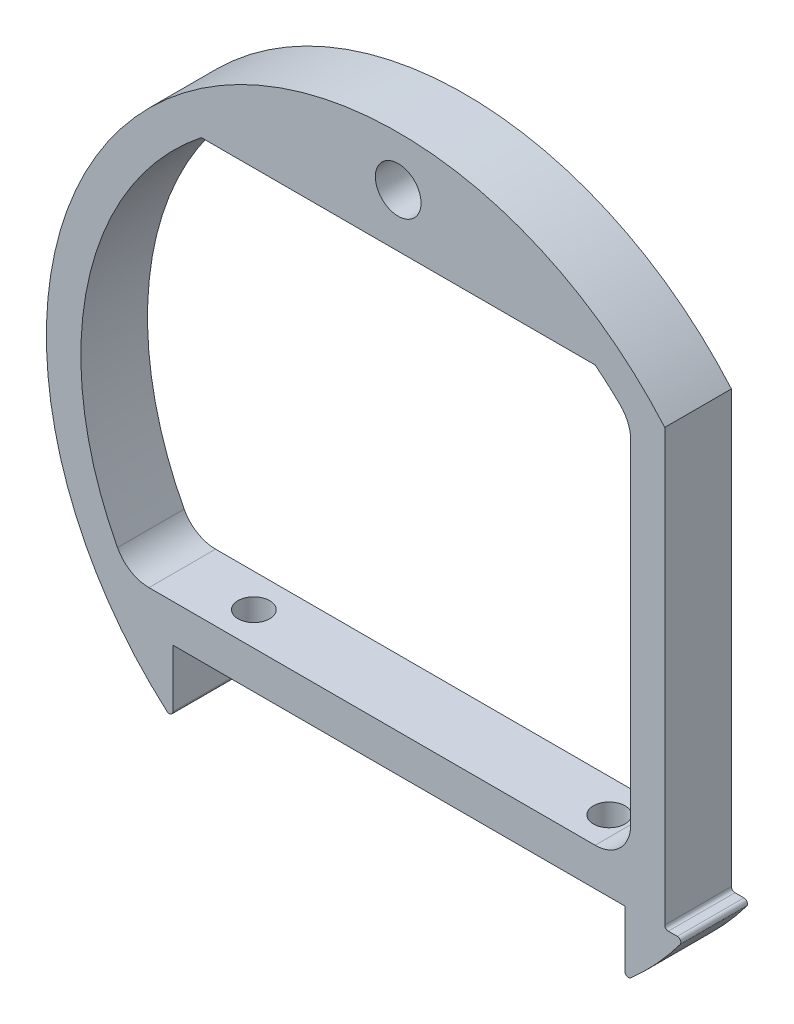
ISO-10303-21;
HEADER;
FILE_DESCRIPTION(('STEP AP214'),'2;1');
FILE_NAME('part.step','',(''),(''),'','','');
FILE_SCHEMA(('AUTOMOTIVE_DESIGN { 1 0 10303 214 1 1 1 1 }'));
ENDSEC;
DATA;
#1=APPLICATION_CONTEXT('core data for automotive mechanical design processes');
#2=APPLICATION_PROTOCOL_DEFINITION('international standard','automotive_design',2000,#1);
#3=PRODUCT_CONTEXT('',#1,'mechanical');
#4=PRODUCT('Part','Part','',(#3));
#5=PRODUCT_RELATED_PRODUCT_CATEGORY('part','',(#4));
#6=PRODUCT_DEFINITION_FORMATION('','',#4);
#7=PRODUCT_DEFINITION_CONTEXT('part definition',#1,'design');
#8=PRODUCT_DEFINITION('design','',#6,#7);
#9=PRODUCT_DEFINITION_SHAPE('','',#8);
#10=(LENGTH_UNIT() NAMED_UNIT(*) SI_UNIT(.MILLI.,.METRE.));
#11=(NAMED_UNIT(*) PLANE_ANGLE_UNIT() SI_UNIT($,.RADIAN.));
#12=(NAMED_UNIT(*) SI_UNIT($,.STERADIAN.) SOLID_ANGLE_UNIT());
#13=UNCERTAINTY_MEASURE_WITH_UNIT(LENGTH_MEASURE(1.E-05),#10,'distance_accuracy_value','');
#14=(GEOMETRIC_REPRESENTATION_CONTEXT(3) GLOBAL_UNCERTAINTY_ASSIGNED_CONTEXT((#13)) GLOBAL_UNIT_ASSIGNED_CONTEXT((#10,
#11,#12)) REPRESENTATION_CONTEXT('',''));
#15=CARTESIAN_POINT('',(0.,0.,0.));
#16=DIRECTION('',(0.,0.,1.));
#17=DIRECTION('',(1.,0.,0.));
#18=AXIS2_PLACEMENT_3D('',#15,#16,#17);
#19=CARTESIAN_POINT('',(0.,0.,0.));
#20=DIRECTION('',(0.,0.,1.));
#21=DIRECTION('',(1.,0.,0.));
#22=AXIS2_PLACEMENT_3D('',#19,#20,#21);
#23=CYLINDRICAL_SURFACE('',#22,22.6822666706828);
#24=DIRECTION('',(0.,0.,1.));
#25=VECTOR('',#24,1.);
#26=CARTESIAN_POINT('',(14.0723451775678,17.7891630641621,0.));
#27=LINE('',#26,#25);
#28=CARTESIAN_POINT('',(14.0723451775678,17.7891630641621,0.));
#29=VERTEX_POINT('',#28);
#30=CARTESIAN_POINT('',(14.0723451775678,17.7891630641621,4.7625));
#31=VERTEX_POINT('',#30);
#32=EDGE_CURVE('E184',#29,#31,#27,.T.);
#33=ORIENTED_EDGE('',*,*,#32,.F.);
#34=CARTESIAN_POINT('',(0.,0.,0.));
#35=DIRECTION('',(0.,0.,1.));
#36=DIRECTION('',(1.,0.,0.));
#37=AXIS2_PLACEMENT_3D('',#34,#35,#36);
#38=CIRCLE('',#37,22.6822666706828);
#39=CARTESIAN_POINT('',(15.8519333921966,16.223483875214,0.));
#40=VERTEX_POINT('',#39);
#41=EDGE_CURVE('E194',#40,#29,#38,.T.);
#42=ORIENTED_EDGE('',*,*,#41,.F.);
#43=DIRECTION('',(0.,0.,1.));
#44=VECTOR('',#43,1.);
#45=CARTESIAN_POINT('',(15.8519333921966,16.223483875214,0.));
#46=LINE('',#45,#44);
#47=CARTESIAN_POINT('',(15.8519333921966,16.223483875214,4.7625));
#48=VERTEX_POINT('',#47);
#49=EDGE_CURVE('E359',#40,#48,#46,.T.);
#50=ORIENTED_EDGE('',*,*,#49,.T.);
#51=CARTESIAN_POINT('',(0.,0.,4.7625));
#52=DIRECTION('',(0.,0.,1.));
#53=DIRECTION('',(1.,0.,0.));
#54=AXIS2_PLACEMENT_3D('',#51,#52,#53);
#55=CIRCLE('',#54,22.6822666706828);
#56=EDGE_CURVE('E219',#48,#31,#55,.T.);
#57=ORIENTED_EDGE('',*,*,#56,.T.);
#58=EDGE_LOOP('',(#33,#42,#50,#57));
#59=FACE_BOUND('',#58,.T.);
#60=ADVANCED_FACE('F44',(#59),#23,.F.);
#61=CARTESIAN_POINT('',(0.,0.,4.7625));
#62=DIRECTION('',(0.,0.,-1.));
#63=DIRECTION('',(-1.,0.,0.));
#64=AXIS2_PLACEMENT_3D('',#61,#62,#63);
#65=CYLINDRICAL_SURFACE('',#64,25.146);
#66=CARTESIAN_POINT('',(0.,0.,0.));
#67=DIRECTION('',(0.,0.,1.));
#68=DIRECTION('',(1.,0.,0.));
#69=AXIS2_PLACEMENT_3D('',#66,#67,#68);
#70=CIRCLE('',#69,25.146);
#71=CARTESIAN_POINT('',(19.05,16.413982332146,0.));
#72=VERTEX_POINT('',#71);
#73=CARTESIAN_POINT('',(-16.5276469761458,-18.9514696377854,0.));
#74=VERTEX_POINT('',#73);
#75=EDGE_CURVE('E290',#72,#74,#70,.T.);
#76=ORIENTED_EDGE('',*,*,#75,.T.);
#77=DIRECTION('',(0.,0.,-1.));
#78=VECTOR('',#77,1.);
#79=CARTESIAN_POINT('',(-16.5276469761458,-18.9514696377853,4.7625));
#80=LINE('',#79,#78);
#81=CARTESIAN_POINT('',(-16.5276469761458,-18.9514696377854,4.7625));
#82=VERTEX_POINT('',#81);
#83=EDGE_CURVE('E341',#74,#82,#80,.F.);
#84=ORIENTED_EDGE('',*,*,#83,.T.);
#85=CARTESIAN_POINT('',(0.,0.,4.7625));
#86=DIRECTION('',(0.,0.,1.));
#87=DIRECTION('',(1.,0.,0.));
#88=AXIS2_PLACEMENT_3D('',#85,#86,#87);
#89=CIRCLE('',#88,25.146);
#90=CARTESIAN_POINT('',(19.05,16.413982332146,4.7625));
#91=VERTEX_POINT('',#90);
#92=EDGE_CURVE('E291',#91,#82,#89,.T.);
#93=ORIENTED_EDGE('',*,*,#92,.F.);
#94=DIRECTION('',(0.,0.,-1.));
#95=VECTOR('',#94,1.);
#96=CARTESIAN_POINT('',(19.05,16.413982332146,4.7625));
#97=LINE('',#96,#95);
#98=EDGE_CURVE('E279',#91,#72,#97,.T.);
#99=ORIENTED_EDGE('',*,*,#98,.T.);
#100=EDGE_LOOP('',(#76,#84,#93,#99));
#101=FACE_BOUND('',#100,.T.);
#102=ADVANCED_FACE('F440',(#101),#65,.T.);
#103=CARTESIAN_POINT('',(0.,0.,4.7625));
#104=DIRECTION('',(0.,0.,1.));
#105=DIRECTION('',(1.,0.,0.));
#106=AXIS2_PLACEMENT_3D('',#103,#104,#105);
#107=PLANE('',#106);
#108=CARTESIAN_POINT('',(0.,21.59,4.7625));
#109=DIRECTION('',(0.,0.,1.));
#110=DIRECTION('',(1.,0.,0.));
#111=AXIS2_PLACEMENT_3D('',#108,#109,#110);
#112=CIRCLE('',#111,1.63195);
#113=CARTESIAN_POINT('',(1.63195,21.59,4.7625));
#114=VERTEX_POINT('',#113);
#115=EDGE_CURVE('E420',#114,#114,#112,.T.);
#116=ORIENTED_EDGE('',*,*,#115,.F.);
#117=EDGE_LOOP('',(#116));
#118=FACE_BOUND('',#117,.T.);
#119=DIRECTION('',(1.,0.,0.));
#120=VECTOR('',#119,1.);
#121=CARTESIAN_POINT('',(-19.2875794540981,-11.9362682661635,4.7625));
#122=LINE('',#121,#120);
#123=CARTESIAN_POINT('',(-17.8163141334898,-11.9362682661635,4.7625));
#124=VERTEX_POINT('',#123);
#125=CARTESIAN_POINT('',(14.0768060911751,-11.9362682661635,4.7625));
#126=VERTEX_POINT('',#125);
#127=EDGE_CURVE('E208',#124,#126,#122,.T.);
#128=ORIENTED_EDGE('',*,*,#127,.F.);
#129=CARTESIAN_POINT('',(-17.8163141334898,-9.39626826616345,4.7625));
#130=DIRECTION('',(0.,0.,1.));
#131=DIRECTION('',(1.,0.,0.));
#132=AXIS2_PLACEMENT_3D('',#129,#130,#131);
#133=CIRCLE('',#132,2.54);
#134=CARTESIAN_POINT('',(-20.06300457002,-10.5811657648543,4.7625));
#135=VERTEX_POINT('',#134);
#136=EDGE_CURVE('E54',#124,#135,#133,.F.);
#137=ORIENTED_EDGE('',*,*,#136,.T.);
#138=CARTESIAN_POINT('',(-14.0723451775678,17.7891630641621,4.7625));
#139=VERTEX_POINT('',#138);
#140=EDGE_CURVE('E218',#139,#135,#55,.T.);
#141=ORIENTED_EDGE('',*,*,#140,.F.);
#142=DIRECTION('',(1.,0.,0.));
#143=VECTOR('',#142,1.);
#144=CARTESIAN_POINT('',(-14.0723451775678,17.7891630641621,4.7625));
#145=LINE('',#144,#143);
#146=EDGE_CURVE('E61',#139,#31,#145,.T.);
#147=ORIENTED_EDGE('',*,*,#146,.T.);
#148=ORIENTED_EDGE('',*,*,#56,.F.);
#149=CARTESIAN_POINT('',(14.0768060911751,14.4067496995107,4.7625));
#150=DIRECTION('',(0.,0.,1.));
#151=DIRECTION('',(1.,0.,0.));
#152=AXIS2_PLACEMENT_3D('',#149,#150,#151);
#153=CIRCLE('',#152,2.54);
#154=CARTESIAN_POINT('',(16.6168060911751,14.4067496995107,4.7625));
#155=VERTEX_POINT('',#154);
#156=EDGE_CURVE('E376',#48,#155,#153,.F.);
#157=ORIENTED_EDGE('',*,*,#156,.T.);
#158=DIRECTION('',(0.,1.,0.));
#159=VECTOR('',#158,1.);
#160=CARTESIAN_POINT('',(16.6168060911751,11.9362682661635,4.7625));
#161=LINE('',#160,#159);
#162=CARTESIAN_POINT('',(16.6168060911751,-9.39626826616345,4.7625));
#163=VERTEX_POINT('',#162);
#164=EDGE_CURVE('E214',#163,#155,#161,.T.);
#165=ORIENTED_EDGE('',*,*,#164,.F.);
#166=CARTESIAN_POINT('',(14.0768060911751,-9.39626826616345,4.7625));
#167=DIRECTION('',(0.,0.,1.));
#168=DIRECTION('',(1.,0.,0.));
#169=AXIS2_PLACEMENT_3D('',#166,#167,#168);
#170=CIRCLE('',#169,2.54);
#171=EDGE_CURVE('E382',#163,#126,#170,.F.);
#172=ORIENTED_EDGE('',*,*,#171,.T.);
#173=EDGE_LOOP('',(#128,#137,#141,#147,#148,#157,#165,#172));
#174=FACE_BOUND('',#173,.T.);
#175=CARTESIAN_POINT('',(0.,0.,4.7625));
#176=DIRECTION('',(0.,0.,1.));
#177=DIRECTION('',(1.,0.,0.));
#178=AXIS2_PLACEMENT_3D('',#175,#176,#177);
#179=CIRCLE('',#178,25.146);
#180=CARTESIAN_POINT('',(16.6160141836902,-18.8740400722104,4.7625));
#181=VERTEX_POINT('',#180);
#182=CARTESIAN_POINT('',(20.1483053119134,-15.0455012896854,4.7625));
#183=VERTEX_POINT('',#182);
#184=EDGE_CURVE('E265',#181,#183,#179,.T.);
#185=ORIENTED_EDGE('',*,*,#184,.T.);
#186=CARTESIAN_POINT('',(19.9447870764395,-14.8935265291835,4.7625));
#187=DIRECTION('',(0.,0.,1.));
#188=DIRECTION('',(1.,0.,0.));
#189=AXIS2_PLACEMENT_3D('',#186,#187,#188);
#190=CIRCLE('',#189,0.254);
#191=CARTESIAN_POINT('',(19.9447870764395,-14.6395265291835,4.7625));
#192=VERTEX_POINT('',#191);
#193=EDGE_CURVE('E325',#183,#192,#190,.T.);
#194=ORIENTED_EDGE('',*,*,#193,.T.);
#195=DIRECTION('',(-1.,0.,0.));
#196=VECTOR('',#195,1.);
#197=CARTESIAN_POINT('',(19.05,-14.6395265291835,4.7625));
#198=LINE('',#197,#196);
#199=CARTESIAN_POINT('',(19.304,-14.6395265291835,4.7625));
#200=VERTEX_POINT('',#199);
#201=EDGE_CURVE('E253',#192,#200,#198,.T.);
#202=ORIENTED_EDGE('',*,*,#201,.T.);
#203=CARTESIAN_POINT('',(19.304,-14.3855265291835,4.7625));
#204=DIRECTION('',(0.,0.,1.));
#205=DIRECTION('',(1.,0.,0.));
#206=AXIS2_PLACEMENT_3D('',#203,#204,#205);
#207=CIRCLE('',#206,0.254);
#208=CARTESIAN_POINT('',(19.05,-14.3855265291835,4.7625));
#209=VERTEX_POINT('',#208);
#210=EDGE_CURVE('E348',#200,#209,#207,.F.);
#211=ORIENTED_EDGE('',*,*,#210,.T.);
#212=DIRECTION('',(0.,-1.,0.));
#213=VECTOR('',#212,1.);
#214=CARTESIAN_POINT('',(19.05,-26.573287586,4.7625));
#215=LINE('',#214,#213);
#216=EDGE_CURVE('E274',#91,#209,#215,.T.);
#217=ORIENTED_EDGE('',*,*,#216,.F.);
#218=ORIENTED_EDGE('',*,*,#92,.T.);
#219=CARTESIAN_POINT('',(-16.3607010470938,-18.7600406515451,4.7625));
#220=DIRECTION('',(0.,0.,1.));
#221=DIRECTION('',(1.,0.,0.));
#222=AXIS2_PLACEMENT_3D('',#219,#220,#221);
#223=CIRCLE('',#222,0.254);
#224=CARTESIAN_POINT('',(-16.1067010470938,-18.7600406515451,4.7625));
#225=VERTEX_POINT('',#224);
#226=EDGE_CURVE('E319',#82,#225,#223,.T.);
#227=ORIENTED_EDGE('',*,*,#226,.T.);
#228=DIRECTION('',(0.,1.,0.));
#229=VECTOR('',#228,1.);
#230=CARTESIAN_POINT('',(-16.1067010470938,-14.6395265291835,4.7625));
#231=LINE('',#230,#229);
#232=CARTESIAN_POINT('',(-16.1067010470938,-14.6395265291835,4.7625));
#233=VERTEX_POINT('',#232);
#234=EDGE_CURVE('E237',#225,#233,#231,.T.);
#235=ORIENTED_EDGE('',*,*,#234,.T.);
#236=DIRECTION('',(-1.,0.,0.));
#237=VECTOR('',#236,1.);
#238=CARTESIAN_POINT('',(-24.918529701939,-14.6395265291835,4.7625));
#239=LINE('',#238,#237);
#240=CARTESIAN_POINT('',(16.1941756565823,-14.6395265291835,4.7625));
#241=VERTEX_POINT('',#240);
#242=EDGE_CURVE('E286',#241,#233,#239,.T.);
#243=ORIENTED_EDGE('',*,*,#242,.F.);
#244=DIRECTION('',(0.,-1.,0.));
#245=VECTOR('',#244,1.);
#246=CARTESIAN_POINT('',(16.1941756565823,-14.6395265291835,4.7625));
#247=LINE('',#246,#245);
#248=CARTESIAN_POINT('',(16.1941756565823,-18.6833932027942,4.7625));
#249=VERTEX_POINT('',#248);
#250=EDGE_CURVE('E247',#241,#249,#247,.T.);
#251=ORIENTED_EDGE('',*,*,#250,.T.);
#252=CARTESIAN_POINT('',(16.4481756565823,-18.6833932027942,4.7625));
#253=DIRECTION('',(0.,0.,1.));
#254=DIRECTION('',(1.,0.,0.));
#255=AXIS2_PLACEMENT_3D('',#252,#253,#254);
#256=CIRCLE('',#255,0.254);
#257=EDGE_CURVE('E322',#249,#181,#256,.T.);
#258=ORIENTED_EDGE('',*,*,#257,.T.);
#259=EDGE_LOOP('',(#185,#194,#202,#211,#217,#218,#227,#235,#243,#251,#258));
#260=FACE_BOUND('',#259,.T.);
#261=ADVANCED_FACE('F393',(#118,#174,#260),#107,.T.);
#262=CARTESIAN_POINT('',(0.,0.,0.));
#263=DIRECTION('',(0.,0.,1.));
#264=DIRECTION('',(1.,0.,0.));
#265=AXIS2_PLACEMENT_3D('',#262,#263,#264);
#266=PLANE('',#265);
#267=CARTESIAN_POINT('',(0.,21.59,0.));
#268=DIRECTION('',(0.,0.,1.));
#269=DIRECTION('',(1.,0.,0.));
#270=AXIS2_PLACEMENT_3D('',#267,#268,#269);
#271=CIRCLE('',#270,1.63195);
#272=CARTESIAN_POINT('',(1.63195,21.59,0.));
#273=VERTEX_POINT('',#272);
#274=EDGE_CURVE('E48',#273,#273,#271,.T.);
#275=ORIENTED_EDGE('',*,*,#274,.T.);
#276=EDGE_LOOP('',(#275));
#277=FACE_BOUND('',#276,.T.);
#278=DIRECTION('',(0.,1.,0.));
#279=VECTOR('',#278,1.);
#280=CARTESIAN_POINT('',(16.6168060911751,11.9362682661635,0.));
#281=LINE('',#280,#279);
#282=CARTESIAN_POINT('',(16.6168060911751,-9.39626826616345,0.));
#283=VERTEX_POINT('',#282);
#284=CARTESIAN_POINT('',(16.6168060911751,14.4067496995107,0.));
#285=VERTEX_POINT('',#284);
#286=EDGE_CURVE('E202',#283,#285,#281,.T.);
#287=ORIENTED_EDGE('',*,*,#286,.T.);
#288=CARTESIAN_POINT('',(14.0768060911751,14.4067496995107,0.));
#289=DIRECTION('',(0.,0.,1.));
#290=DIRECTION('',(1.,0.,0.));
#291=AXIS2_PLACEMENT_3D('',#288,#289,#290);
#292=CIRCLE('',#291,2.54);
#293=EDGE_CURVE('E379',#285,#40,#292,.T.);
#294=ORIENTED_EDGE('',*,*,#293,.T.);
#295=ORIENTED_EDGE('',*,*,#41,.T.);
#296=DIRECTION('',(1.,0.,0.));
#297=VECTOR('',#296,1.);
#298=CARTESIAN_POINT('',(-14.0723451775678,17.7891630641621,0.));
#299=LINE('',#298,#297);
#300=CARTESIAN_POINT('',(-14.0723451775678,17.7891630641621,0.));
#301=VERTEX_POINT('',#300);
#302=EDGE_CURVE('E178',#301,#29,#299,.T.);
#303=ORIENTED_EDGE('',*,*,#302,.F.);
#304=CARTESIAN_POINT('',(-20.06300457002,-10.5811657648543,0.));
#305=VERTEX_POINT('',#304);
#306=EDGE_CURVE('E191',#301,#305,#38,.T.);
#307=ORIENTED_EDGE('',*,*,#306,.T.);
#308=CARTESIAN_POINT('',(-17.8163141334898,-9.39626826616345,0.));
#309=DIRECTION('',(0.,0.,1.));
#310=DIRECTION('',(1.,0.,0.));
#311=AXIS2_PLACEMENT_3D('',#308,#309,#310);
#312=CIRCLE('',#311,2.54);
#313=CARTESIAN_POINT('',(-17.8163141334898,-11.9362682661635,0.));
#314=VERTEX_POINT('',#313);
#315=EDGE_CURVE('E11',#305,#314,#312,.T.);
#316=ORIENTED_EDGE('',*,*,#315,.T.);
#317=DIRECTION('',(1.,0.,0.));
#318=VECTOR('',#317,1.);
#319=CARTESIAN_POINT('',(-19.2875794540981,-11.9362682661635,0.));
#320=LINE('',#319,#318);
#321=CARTESIAN_POINT('',(14.0768060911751,-11.9362682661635,0.));
#322=VERTEX_POINT('',#321);
#323=EDGE_CURVE('E207',#314,#322,#320,.T.);
#324=ORIENTED_EDGE('',*,*,#323,.T.);
#325=CARTESIAN_POINT('',(14.0768060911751,-9.39626826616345,0.));
#326=DIRECTION('',(0.,0.,1.));
#327=DIRECTION('',(1.,0.,0.));
#328=AXIS2_PLACEMENT_3D('',#325,#326,#327);
#329=CIRCLE('',#328,2.54);
#330=EDGE_CURVE('E385',#322,#283,#329,.T.);
#331=ORIENTED_EDGE('',*,*,#330,.T.);
#332=EDGE_LOOP('',(#287,#294,#295,#303,#307,#316,#324,#331));
#333=FACE_BOUND('',#332,.T.);
#334=DIRECTION('',(-1.,0.,0.));
#335=VECTOR('',#334,1.);
#336=CARTESIAN_POINT('',(16.1941756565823,-14.6395265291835,0.));
#337=LINE('',#336,#335);
#338=CARTESIAN_POINT('',(19.9447870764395,-14.6395265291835,0.));
#339=VERTEX_POINT('',#338);
#340=CARTESIAN_POINT('',(19.304,-14.6395265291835,0.));
#341=VERTEX_POINT('',#340);
#342=EDGE_CURVE('E248',#339,#341,#337,.T.);
#343=ORIENTED_EDGE('',*,*,#342,.F.);
#344=CARTESIAN_POINT('',(19.9447870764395,-14.8935265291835,0.));
#345=DIRECTION('',(0.,0.,1.));
#346=DIRECTION('',(1.,0.,0.));
#347=AXIS2_PLACEMENT_3D('',#344,#345,#346);
#348=CIRCLE('',#347,0.254);
#349=CARTESIAN_POINT('',(20.1483053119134,-15.0455012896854,0.));
#350=VERTEX_POINT('',#349);
#351=EDGE_CURVE('E334',#339,#350,#348,.F.);
#352=ORIENTED_EDGE('',*,*,#351,.T.);
#353=CARTESIAN_POINT('',(0.,0.,0.));
#354=DIRECTION('',(0.,0.,1.));
#355=DIRECTION('',(1.,0.,0.));
#356=AXIS2_PLACEMENT_3D('',#353,#354,#355);
#357=CIRCLE('',#356,25.146);
#358=CARTESIAN_POINT('',(16.6160141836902,-18.8740400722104,0.));
#359=VERTEX_POINT('',#358);
#360=EDGE_CURVE('E257',#359,#350,#357,.T.);
#361=ORIENTED_EDGE('',*,*,#360,.F.);
#362=CARTESIAN_POINT('',(16.4481756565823,-18.6833932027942,0.));
#363=DIRECTION('',(0.,0.,1.));
#364=DIRECTION('',(1.,0.,0.));
#365=AXIS2_PLACEMENT_3D('',#362,#363,#364);
#366=CIRCLE('',#365,0.254);
#367=CARTESIAN_POINT('',(16.1941756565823,-18.6833932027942,0.));
#368=VERTEX_POINT('',#367);
#369=EDGE_CURVE('E331',#359,#368,#366,.F.);
#370=ORIENTED_EDGE('',*,*,#369,.T.);
#371=DIRECTION('',(0.,-1.,0.));
#372=VECTOR('',#371,1.);
#373=CARTESIAN_POINT('',(16.1941756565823,-14.6395265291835,0.));
#374=LINE('',#373,#372);
#375=CARTESIAN_POINT('',(16.1941756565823,-14.6395265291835,0.));
#376=VERTEX_POINT('',#375);
#377=EDGE_CURVE('E252',#376,#368,#374,.T.);
#378=ORIENTED_EDGE('',*,*,#377,.F.);
#379=DIRECTION('',(-1.,0.,0.));
#380=VECTOR('',#379,1.);
#381=CARTESIAN_POINT('',(0.,-14.6395265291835,0.));
#382=LINE('',#381,#380);
#383=CARTESIAN_POINT('',(-16.1067010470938,-14.6395265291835,0.));
#384=VERTEX_POINT('',#383);
#385=EDGE_CURVE('E295',#376,#384,#382,.T.);
#386=ORIENTED_EDGE('',*,*,#385,.T.);
#387=DIRECTION('',(0.,1.,0.));
#388=VECTOR('',#387,1.);
#389=CARTESIAN_POINT('',(-16.1067010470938,-14.6395265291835,0.));
#390=LINE('',#389,#388);
#391=CARTESIAN_POINT('',(-16.1067010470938,-18.7600406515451,0.));
#392=VERTEX_POINT('',#391);
#393=EDGE_CURVE('E238',#392,#384,#390,.T.);
#394=ORIENTED_EDGE('',*,*,#393,.F.);
#395=CARTESIAN_POINT('',(-16.3607010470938,-18.7600406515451,0.));
#396=DIRECTION('',(0.,0.,1.));
#397=DIRECTION('',(1.,0.,0.));
#398=AXIS2_PLACEMENT_3D('',#395,#396,#397);
#399=CIRCLE('',#398,0.254);
#400=EDGE_CURVE('E328',#392,#74,#399,.F.);
#401=ORIENTED_EDGE('',*,*,#400,.T.);
#402=ORIENTED_EDGE('',*,*,#75,.F.);
#403=DIRECTION('',(0.,-1.,0.));
#404=VECTOR('',#403,1.);
#405=CARTESIAN_POINT('',(19.05,-26.573287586,0.));
#406=LINE('',#405,#404);
#407=CARTESIAN_POINT('',(19.05,-14.3855265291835,0.));
#408=VERTEX_POINT('',#407);
#409=EDGE_CURVE('E275',#72,#408,#406,.T.);
#410=ORIENTED_EDGE('',*,*,#409,.T.);
#411=CARTESIAN_POINT('',(19.304,-14.3855265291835,0.));
#412=DIRECTION('',(0.,0.,1.));
#413=DIRECTION('',(1.,0.,0.));
#414=AXIS2_PLACEMENT_3D('',#411,#412,#413);
#415=CIRCLE('',#414,0.254);
#416=EDGE_CURVE('E351',#408,#341,#415,.T.);
#417=ORIENTED_EDGE('',*,*,#416,.T.);
#418=EDGE_LOOP('',(#343,#352,#361,#370,#378,#386,#394,#401,#402,#410,#417));
#419=FACE_BOUND('',#418,.T.);
#420=ADVANCED_FACE('F189',(#277,#333,#419),#266,.F.);
#421=CARTESIAN_POINT('',(-24.918529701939,-14.6395265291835,0.));
#422=DIRECTION('',(0.,1.,0.));
#423=DIRECTION('',(0.,0.,1.));
#424=AXIS2_PLACEMENT_3D('',#421,#422,#423);
#425=PLANE('',#424);
#426=CARTESIAN_POINT('',(-12.7,-14.6395265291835,2.38125));
#427=DIRECTION('',(0.,-1.,0.));
#428=DIRECTION('',(0.,0.,-1.));
#429=AXIS2_PLACEMENT_3D('',#426,#427,#428);
#430=CIRCLE('',#429,1.13029999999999);
#431=CARTESIAN_POINT('',(-12.7,-14.6395265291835,1.25095000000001));
#432=VERTEX_POINT('',#431);
#433=EDGE_CURVE('E229',#432,#432,#430,.T.);
#434=ORIENTED_EDGE('',*,*,#433,.F.);
#435=EDGE_LOOP('',(#434));
#436=FACE_BOUND('',#435,.T.);
#437=CARTESIAN_POINT('',(12.7,-14.6395265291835,2.38125));
#438=DIRECTION('',(0.,-1.,0.));
#439=DIRECTION('',(0.,0.,-1.));
#440=AXIS2_PLACEMENT_3D('',#437,#438,#439);
#441=CIRCLE('',#440,1.13029999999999);
#442=CARTESIAN_POINT('',(12.7,-14.6395265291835,1.25095000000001));
#443=VERTEX_POINT('',#442);
#444=EDGE_CURVE('E233',#443,#443,#441,.T.);
#445=ORIENTED_EDGE('',*,*,#444,.F.);
#446=EDGE_LOOP('',(#445));
#447=FACE_BOUND('',#446,.T.);
#448=ORIENTED_EDGE('',*,*,#242,.T.);
#449=DIRECTION('',(0.,0.,1.));
#450=VECTOR('',#449,1.);
#451=CARTESIAN_POINT('',(-16.1067010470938,-14.6395265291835,0.));
#452=LINE('',#451,#450);
#453=EDGE_CURVE('E241',#384,#233,#452,.T.);
#454=ORIENTED_EDGE('',*,*,#453,.F.);
#455=ORIENTED_EDGE('',*,*,#385,.F.);
#456=DIRECTION('',(0.,0.,1.));
#457=VECTOR('',#456,1.);
#458=CARTESIAN_POINT('',(16.1941756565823,-14.6395265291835,0.));
#459=LINE('',#458,#457);
#460=EDGE_CURVE('E261',#376,#241,#459,.T.);
#461=ORIENTED_EDGE('',*,*,#460,.T.);
#462=EDGE_LOOP('',(#448,#454,#455,#461));
#463=FACE_BOUND('',#462,.T.);
#464=ADVANCED_FACE('F466',(#436,#447,#463),#425,.F.);
#465=CARTESIAN_POINT('',(19.05,-26.573287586,0.));
#466=DIRECTION('',(-1.,0.,0.));
#467=DIRECTION('',(0.,0.,1.));
#468=AXIS2_PLACEMENT_3D('',#465,#466,#467);
#469=PLANE('',#468);
#470=ORIENTED_EDGE('',*,*,#216,.T.);
#471=DIRECTION('',(0.,0.,1.));
#472=VECTOR('',#471,1.);
#473=CARTESIAN_POINT('',(19.05,-14.3855265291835,0.));
#474=LINE('',#473,#472);
#475=EDGE_CURVE('E309',#209,#408,#474,.F.);
#476=ORIENTED_EDGE('',*,*,#475,.T.);
#477=ORIENTED_EDGE('',*,*,#409,.F.);
#478=ORIENTED_EDGE('',*,*,#98,.F.);
#479=EDGE_LOOP('',(#470,#476,#477,#478));
#480=FACE_BOUND('',#479,.T.);
#481=ADVANCED_FACE('F469',(#480),#469,.F.);
#482=CARTESIAN_POINT('',(19.05,-14.6395265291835,0.));
#483=DIRECTION('',(0.,1.,0.));
#484=DIRECTION('',(0.,0.,1.));
#485=AXIS2_PLACEMENT_3D('',#482,#483,#484);
#486=PLANE('',#485);
#487=ORIENTED_EDGE('',*,*,#342,.T.);
#488=DIRECTION('',(0.,0.,1.));
#489=VECTOR('',#488,1.);
#490=CARTESIAN_POINT('',(19.304,-14.6395265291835,0.));
#491=LINE('',#490,#489);
#492=EDGE_CURVE('E305',#341,#200,#491,.T.);
#493=ORIENTED_EDGE('',*,*,#492,.T.);
#494=ORIENTED_EDGE('',*,*,#201,.F.);
#495=DIRECTION('',(0.,0.,1.));
#496=VECTOR('',#495,1.);
#497=CARTESIAN_POINT('',(19.9447870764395,-14.6395265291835,0.));
#498=LINE('',#497,#496);
#499=EDGE_CURVE('E302',#192,#339,#498,.F.);
#500=ORIENTED_EDGE('',*,*,#499,.T.);
#501=EDGE_LOOP('',(#487,#493,#494,#500));
#502=FACE_BOUND('',#501,.T.);
#503=ADVANCED_FACE('F499',(#502),#486,.T.);
#504=CARTESIAN_POINT('',(0.,0.,0.));
#505=DIRECTION('',(0.,0.,1.));
#506=DIRECTION('',(1.,0.,0.));
#507=AXIS2_PLACEMENT_3D('',#504,#505,#506);
#508=CYLINDRICAL_SURFACE('',#507,25.146);
#509=ORIENTED_EDGE('',*,*,#360,.T.);
#510=DIRECTION('',(0.,0.,1.));
#511=VECTOR('',#510,1.);
#512=CARTESIAN_POINT('',(20.1483053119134,-15.0455012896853,0.));
#513=LINE('',#512,#511);
#514=EDGE_CURVE('E315',#350,#183,#513,.T.);
#515=ORIENTED_EDGE('',*,*,#514,.T.);
#516=ORIENTED_EDGE('',*,*,#184,.F.);
#517=DIRECTION('',(0.,0.,1.));
#518=VECTOR('',#517,1.);
#519=CARTESIAN_POINT('',(16.6160141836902,-18.8740400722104,0.));
#520=LINE('',#519,#518);
#521=EDGE_CURVE('E312',#181,#359,#520,.F.);
#522=ORIENTED_EDGE('',*,*,#521,.T.);
#523=EDGE_LOOP('',(#509,#515,#516,#522));
#524=FACE_BOUND('',#523,.T.);
#525=ADVANCED_FACE('F508',(#524),#508,.T.);
#526=CARTESIAN_POINT('',(16.1941756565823,-14.6395265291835,0.));
#527=DIRECTION('',(-1.,0.,0.));
#528=DIRECTION('',(0.,0.,1.));
#529=AXIS2_PLACEMENT_3D('',#526,#527,#528);
#530=PLANE('',#529);
#531=ORIENTED_EDGE('',*,*,#377,.T.);
#532=DIRECTION('',(0.,0.,1.));
#533=VECTOR('',#532,1.);
#534=CARTESIAN_POINT('',(16.1941756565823,-18.6833932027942,0.));
#535=LINE('',#534,#533);
#536=EDGE_CURVE('E337',#368,#249,#535,.T.);
#537=ORIENTED_EDGE('',*,*,#536,.T.);
#538=ORIENTED_EDGE('',*,*,#250,.F.);
#539=ORIENTED_EDGE('',*,*,#460,.F.);
#540=EDGE_LOOP('',(#531,#537,#538,#539));
#541=FACE_BOUND('',#540,.T.);
#542=ADVANCED_FACE('F515',(#541),#530,.T.);
#543=CARTESIAN_POINT('',(-16.1067010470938,-14.6395265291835,0.));
#544=DIRECTION('',(1.,0.,0.));
#545=DIRECTION('',(0.,0.,-1.));
#546=AXIS2_PLACEMENT_3D('',#543,#544,#545);
#547=PLANE('',#546);
#548=ORIENTED_EDGE('',*,*,#234,.F.);
#549=DIRECTION('',(0.,0.,1.));
#550=VECTOR('',#549,1.);
#551=CARTESIAN_POINT('',(-16.1067010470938,-18.7600406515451,0.));
#552=LINE('',#551,#550);
#553=EDGE_CURVE('E345',#225,#392,#552,.F.);
#554=ORIENTED_EDGE('',*,*,#553,.T.);
#555=ORIENTED_EDGE('',*,*,#393,.T.);
#556=ORIENTED_EDGE('',*,*,#453,.T.);
#557=EDGE_LOOP('',(#548,#554,#555,#556));
#558=FACE_BOUND('',#557,.T.);
#559=ADVANCED_FACE('F479',(#558),#547,.T.);
#560=CARTESIAN_POINT('',(19.304,-14.3855265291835,0.));
#561=DIRECTION('',(0.,0.,1.));
#562=DIRECTION('',(1.,0.,0.));
#563=AXIS2_PLACEMENT_3D('',#560,#561,#562);
#564=CYLINDRICAL_SURFACE('',#563,0.254);
#565=ORIENTED_EDGE('',*,*,#416,.F.);
#566=ORIENTED_EDGE('',*,*,#475,.F.);
#567=ORIENTED_EDGE('',*,*,#210,.F.);
#568=ORIENTED_EDGE('',*,*,#492,.F.);
#569=EDGE_LOOP('',(#565,#566,#567,#568));
#570=FACE_BOUND('',#569,.T.);
#571=ADVANCED_FACE('F495',(#570),#564,.F.);
#572=CARTESIAN_POINT('',(19.9447870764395,-14.8935265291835,0.));
#573=DIRECTION('',(0.,0.,1.));
#574=DIRECTION('',(1.,0.,0.));
#575=AXIS2_PLACEMENT_3D('',#572,#573,#574);
#576=CYLINDRICAL_SURFACE('',#575,0.254);
#577=ORIENTED_EDGE('',*,*,#351,.F.);
#578=ORIENTED_EDGE('',*,*,#499,.F.);
#579=ORIENTED_EDGE('',*,*,#193,.F.);
#580=ORIENTED_EDGE('',*,*,#514,.F.);
#581=EDGE_LOOP('',(#577,#578,#579,#580));
#582=FACE_BOUND('',#581,.T.);
#583=ADVANCED_FACE('F503',(#582),#576,.T.);
#584=CARTESIAN_POINT('',(16.4481756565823,-18.6833932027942,0.));
#585=DIRECTION('',(0.,0.,1.));
#586=DIRECTION('',(1.,0.,0.));
#587=AXIS2_PLACEMENT_3D('',#584,#585,#586);
#588=CYLINDRICAL_SURFACE('',#587,0.254);
#589=ORIENTED_EDGE('',*,*,#369,.F.);
#590=ORIENTED_EDGE('',*,*,#521,.F.);
#591=ORIENTED_EDGE('',*,*,#257,.F.);
#592=ORIENTED_EDGE('',*,*,#536,.F.);
#593=EDGE_LOOP('',(#589,#590,#591,#592));
#594=FACE_BOUND('',#593,.T.);
#595=ADVANCED_FACE('F512',(#594),#588,.T.);
#596=CARTESIAN_POINT('',(-16.3607010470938,-18.7600406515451,4.7625));
#597=DIRECTION('',(0.,0.,-1.));
#598=DIRECTION('',(-1.,0.,0.));
#599=AXIS2_PLACEMENT_3D('',#596,#597,#598);
#600=CYLINDRICAL_SURFACE('',#599,0.254);
#601=ORIENTED_EDGE('',*,*,#400,.F.);
#602=ORIENTED_EDGE('',*,*,#553,.F.);
#603=ORIENTED_EDGE('',*,*,#226,.F.);
#604=ORIENTED_EDGE('',*,*,#83,.F.);
#605=EDGE_LOOP('',(#601,#602,#603,#604));
#606=FACE_BOUND('',#605,.T.);
#607=ADVANCED_FACE('F488',(#606),#600,.T.);
#608=CARTESIAN_POINT('',(12.7,-14.6395265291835,2.38125));
#609=DIRECTION('',(0.,-1.,0.));
#610=DIRECTION('',(0.,0.,-1.));
#611=AXIS2_PLACEMENT_3D('',#608,#609,#610);
#612=CYLINDRICAL_SURFACE('',#611,1.13029999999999);
#613=CARTESIAN_POINT('',(12.7,-11.9362682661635,2.38125));
#614=DIRECTION('',(0.,-1.,0.));
#615=DIRECTION('',(0.,0.,-1.));
#616=AXIS2_PLACEMENT_3D('',#613,#614,#615);
#617=CIRCLE('',#616,1.13029999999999);
#618=CARTESIAN_POINT('',(12.7,-11.9362682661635,1.25095000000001));
#619=VERTEX_POINT('',#618);
#620=EDGE_CURVE('E225',#619,#619,#617,.F.);
#621=ORIENTED_EDGE('',*,*,#620,.T.);
#622=EDGE_LOOP('',(#621));
#623=FACE_BOUND('',#622,.T.);
#624=ORIENTED_EDGE('',*,*,#444,.T.);
#625=EDGE_LOOP('',(#624));
#626=FACE_BOUND('',#625,.T.);
#627=ADVANCED_FACE('F459',(#623,#626),#612,.F.);
#628=CARTESIAN_POINT('',(-12.7,-14.6395265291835,2.38125));
#629=DIRECTION('',(0.,-1.,0.));
#630=DIRECTION('',(0.,0.,-1.));
#631=AXIS2_PLACEMENT_3D('',#628,#629,#630);
#632=CYLINDRICAL_SURFACE('',#631,1.13029999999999);
#633=CARTESIAN_POINT('',(-12.7,-11.9362682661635,2.38125));
#634=DIRECTION('',(0.,-1.,0.));
#635=DIRECTION('',(0.,0.,-1.));
#636=AXIS2_PLACEMENT_3D('',#633,#634,#635);
#637=CIRCLE('',#636,1.13029999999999);
#638=CARTESIAN_POINT('',(-12.7,-11.9362682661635,1.25095000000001));
#639=VERTEX_POINT('',#638);
#640=EDGE_CURVE('E213',#639,#639,#637,.F.);
#641=ORIENTED_EDGE('',*,*,#640,.T.);
#642=EDGE_LOOP('',(#641));
#643=FACE_BOUND('',#642,.T.);
#644=ORIENTED_EDGE('',*,*,#433,.T.);
#645=EDGE_LOOP('',(#644));
#646=FACE_BOUND('',#645,.T.);
#647=ADVANCED_FACE('F454',(#643,#646),#632,.F.);
#648=CARTESIAN_POINT('',(-19.2875794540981,-11.9362682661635,0.));
#649=DIRECTION('',(0.,-1.,0.));
#650=DIRECTION('',(0.,0.,-1.));
#651=AXIS2_PLACEMENT_3D('',#648,#649,#650);
#652=PLANE('',#651);
#653=ORIENTED_EDGE('',*,*,#640,.F.);
#654=EDGE_LOOP('',(#653));
#655=FACE_BOUND('',#654,.T.);
#656=ORIENTED_EDGE('',*,*,#127,.T.);
#657=DIRECTION('',(0.,0.,1.));
#658=VECTOR('',#657,1.);
#659=CARTESIAN_POINT('',(14.0768060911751,-11.9362682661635,0.));
#660=LINE('',#659,#658);
#661=EDGE_CURVE('E69',#126,#322,#660,.F.);
#662=ORIENTED_EDGE('',*,*,#661,.T.);
#663=ORIENTED_EDGE('',*,*,#323,.F.);
#664=DIRECTION('',(0.,0.,-1.));
#665=VECTOR('',#664,1.);
#666=CARTESIAN_POINT('',(-17.8163141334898,-11.9362682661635,4.7625));
#667=LINE('',#666,#665);
#668=EDGE_CURVE('E370',#314,#124,#667,.F.);
#669=ORIENTED_EDGE('',*,*,#668,.T.);
#670=EDGE_LOOP('',(#656,#662,#663,#669));
#671=FACE_BOUND('',#670,.T.);
#672=ORIENTED_EDGE('',*,*,#620,.F.);
#673=EDGE_LOOP('',(#672));
#674=FACE_BOUND('',#673,.T.);
#675=ADVANCED_FACE('F398',(#655,#671,#674),#652,.F.);
#676=ORIENTED_EDGE('',*,*,#306,.F.);
#677=DIRECTION('',(0.,0.,1.));
#678=VECTOR('',#677,1.);
#679=CARTESIAN_POINT('',(-14.0723451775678,17.7891630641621,0.));
#680=LINE('',#679,#678);
#681=EDGE_CURVE('E175',#301,#139,#680,.T.);
#682=ORIENTED_EDGE('',*,*,#681,.T.);
#683=ORIENTED_EDGE('',*,*,#140,.T.);
#684=DIRECTION('',(0.,0.,1.));
#685=VECTOR('',#684,1.);
#686=CARTESIAN_POINT('',(-20.06300457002,-10.5811657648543,0.));
#687=LINE('',#686,#685);
#688=EDGE_CURVE('E199',#135,#305,#687,.F.);
#689=ORIENTED_EDGE('',*,*,#688,.T.);
#690=EDGE_LOOP('',(#676,#682,#683,#689));
#691=FACE_BOUND('',#690,.T.);
#692=ADVANCED_FACE('F197',(#691),#23,.F.);
#693=CARTESIAN_POINT('',(16.6168060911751,11.9362682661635,0.));
#694=DIRECTION('',(1.,0.,0.));
#695=DIRECTION('',(0.,0.,-1.));
#696=AXIS2_PLACEMENT_3D('',#693,#694,#695);
#697=PLANE('',#696);
#698=ORIENTED_EDGE('',*,*,#164,.T.);
#699=DIRECTION('',(0.,0.,-1.));
#700=VECTOR('',#699,1.);
#701=CARTESIAN_POINT('',(16.6168060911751,14.4067496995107,0.));
#702=LINE('',#701,#700);
#703=EDGE_CURVE('E367',#155,#285,#702,.T.);
#704=ORIENTED_EDGE('',*,*,#703,.T.);
#705=ORIENTED_EDGE('',*,*,#286,.F.);
#706=DIRECTION('',(0.,0.,1.));
#707=VECTOR('',#706,1.);
#708=CARTESIAN_POINT('',(16.6168060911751,-9.39626826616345,4.7625));
#709=LINE('',#708,#707);
#710=EDGE_CURVE('E363',#283,#163,#709,.T.);
#711=ORIENTED_EDGE('',*,*,#710,.T.);
#712=EDGE_LOOP('',(#698,#704,#705,#711));
#713=FACE_BOUND('',#712,.T.);
#714=ADVANCED_FACE('F406',(#713),#697,.F.);
#715=CARTESIAN_POINT('',(14.0768060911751,14.4067496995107,0.));
#716=DIRECTION('',(0.,0.,1.));
#717=DIRECTION('',(1.,0.,0.));
#718=AXIS2_PLACEMENT_3D('',#715,#716,#717);
#719=CYLINDRICAL_SURFACE('',#718,2.54);
#720=ORIENTED_EDGE('',*,*,#293,.F.);
#721=ORIENTED_EDGE('',*,*,#703,.F.);
#722=ORIENTED_EDGE('',*,*,#156,.F.);
#723=ORIENTED_EDGE('',*,*,#49,.F.);
#724=EDGE_LOOP('',(#720,#721,#722,#723));
#725=FACE_BOUND('',#724,.T.);
#726=ADVANCED_FACE('F410',(#725),#719,.F.);
#727=CARTESIAN_POINT('',(14.0768060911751,-9.39626826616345,0.));
#728=DIRECTION('',(0.,0.,-1.));
#729=DIRECTION('',(-1.,0.,0.));
#730=AXIS2_PLACEMENT_3D('',#727,#728,#729);
#731=CYLINDRICAL_SURFACE('',#730,2.54);
#732=ORIENTED_EDGE('',*,*,#330,.F.);
#733=ORIENTED_EDGE('',*,*,#661,.F.);
#734=ORIENTED_EDGE('',*,*,#171,.F.);
#735=ORIENTED_EDGE('',*,*,#710,.F.);
#736=EDGE_LOOP('',(#732,#733,#734,#735));
#737=FACE_BOUND('',#736,.T.);
#738=ADVANCED_FACE('F401',(#737),#731,.F.);
#739=CARTESIAN_POINT('',(-17.8163141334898,-9.39626826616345,0.));
#740=DIRECTION('',(0.,0.,1.));
#741=DIRECTION('',(1.,0.,0.));
#742=AXIS2_PLACEMENT_3D('',#739,#740,#741);
#743=CYLINDRICAL_SURFACE('',#742,2.54);
#744=ORIENTED_EDGE('',*,*,#315,.F.);
#745=ORIENTED_EDGE('',*,*,#688,.F.);
#746=ORIENTED_EDGE('',*,*,#136,.F.);
#747=ORIENTED_EDGE('',*,*,#668,.F.);
#748=EDGE_LOOP('',(#744,#745,#746,#747));
#749=FACE_BOUND('',#748,.T.);
#750=ADVANCED_FACE('F46',(#749),#743,.F.);
#751=CARTESIAN_POINT('',(-14.0723451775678,17.7891630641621,0.));
#752=DIRECTION('',(0.,-1.,0.));
#753=DIRECTION('',(0.,0.,-1.));
#754=AXIS2_PLACEMENT_3D('',#751,#752,#753);
#755=PLANE('',#754);
#756=ORIENTED_EDGE('',*,*,#146,.F.);
#757=ORIENTED_EDGE('',*,*,#681,.F.);
#758=ORIENTED_EDGE('',*,*,#302,.T.);
#759=ORIENTED_EDGE('',*,*,#32,.T.);
#760=EDGE_LOOP('',(#756,#757,#758,#759));
#761=FACE_BOUND('',#760,.T.);
#762=ADVANCED_FACE('F177',(#761),#755,.T.);
#763=CARTESIAN_POINT('',(0.,21.59,4.7625));
#764=DIRECTION('',(0.,0.,1.));
#765=DIRECTION('',(1.,0.,0.));
#766=AXIS2_PLACEMENT_3D('',#763,#764,#765);
#767=CYLINDRICAL_SURFACE('',#766,1.63195);
#768=ORIENTED_EDGE('',*,*,#115,.T.);
#769=EDGE_LOOP('',(#768));
#770=FACE_BOUND('',#769,.T.);
#771=ORIENTED_EDGE('',*,*,#274,.F.);
#772=EDGE_LOOP('',(#771));
#773=FACE_BOUND('',#772,.T.);
#774=ADVANCED_FACE('F432',(#770,#773),#767,.F.);
#775=CLOSED_SHELL('',(#60,#102,#261,#420,#464,#481,#503,#525,#542,#559,#571,#583,#595,#607,#627,
#647,#675,#692,#714,#726,#738,#750,#762,#774));
#776=MANIFOLD_SOLID_BREP('B2',#775);
#777=ADVANCED_BREP_SHAPE_REPRESENTATION('',(#18,#776),#14);
#778=SHAPE_DEFINITION_REPRESENTATION(#9,#777);
ENDSEC;
END-ISO-10303-21;
